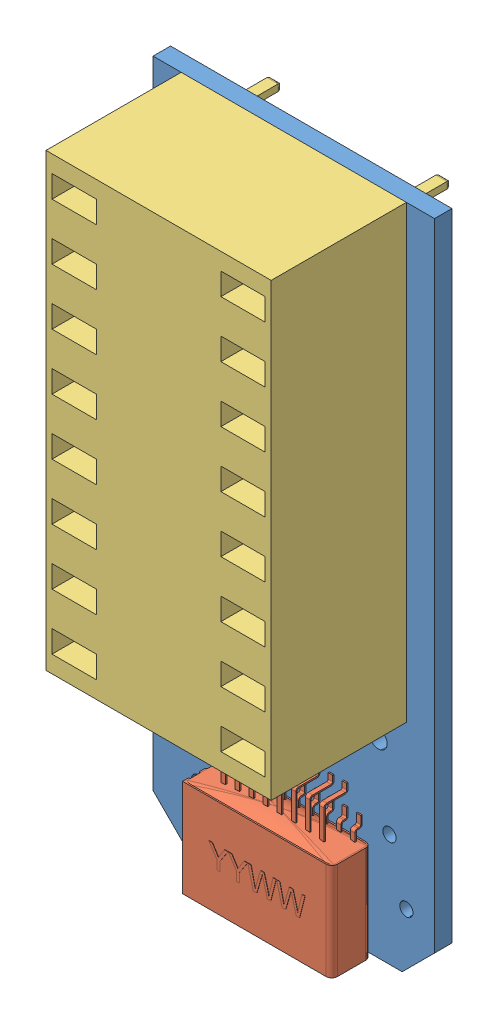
SolidWorks assembly Electrode_Adapter_18pin_socket.SLDASM, configuration Default (file format 15000). Lengths in mm.
Overall size (12.7 30.29 9.1).
3 component instances, 3 part files, 6 mates.
Components (placement in the parent):
- Electrode_Adapter_18pin_PCB-1: Electrode_Adapter_18pin_PCB.SLDPRT [Default] at origin size (12.7 30.16 0.79)
- A79040-001-1: A79040-001.SLDPRT [Default] at (6.477 2.0701 1.6764) x (1 0 0) z (0 -1 0) size (6.73 1.8 6.3)
- DIP16_Socket-1: DIP16_Socket.SLDPRT [Default] at (6.35 20.0025 0.7874) x (0 -1 0) z (-1 0 0) size (20.32 9.1 10.16)
Mates (geometry in assembly coordinates):
- Coincident1: coincident anti-aligned: plane of Electrode_Adapter_18pin-1 through (0 0 0.7874) normal (0 0 1); plane of A79040-001-1 through (-5.7785 4.2672 0.7874) normal (0 0 -1)
- Parallel1: parallel aligned: plane of Electrode_Adapter_18pin-1 through (11.2395 0 0.7874) normal (0 -1 0); plane of A79040-001-1 through (-5.7785 -0.127 2.5654) normal (0 -1 0)
- Distance1: distance = 0.127 mm: line of A79040-001-1 through (3.1115 -0.127 0.7874) axis (1 0 0); line of Electrode_Adapter_18pin-1 through (1.4605 0 0.7874) axis (1 0 0)
- Distance2: distance = 3.1115 mm: line of A79040-001-1 through (3.1115 4.2672 0.7874) axis (0 -1 0); line of Electrode_Adapter_18pin-1 through (0 30.1625 0.7874) axis (0 -1 0)
- Coincident4: coincident anti-aligned: plane of Electrode_Adapter_18pin-1 through (0 0 0.7874) normal (0 0 1); plane of DIP16_Socket-1 through (6.35 20.0025 0.7874) normal (0 0 -1)
- Parallel2: parallel aligned: plane of Electrode_Adapter_18pin-1 through (0 30.1625 0.7874) normal (0 1 0); plane of DIP16_Socket-1 through (11.43 30.1625 6.8874) normal (0 1 0)
